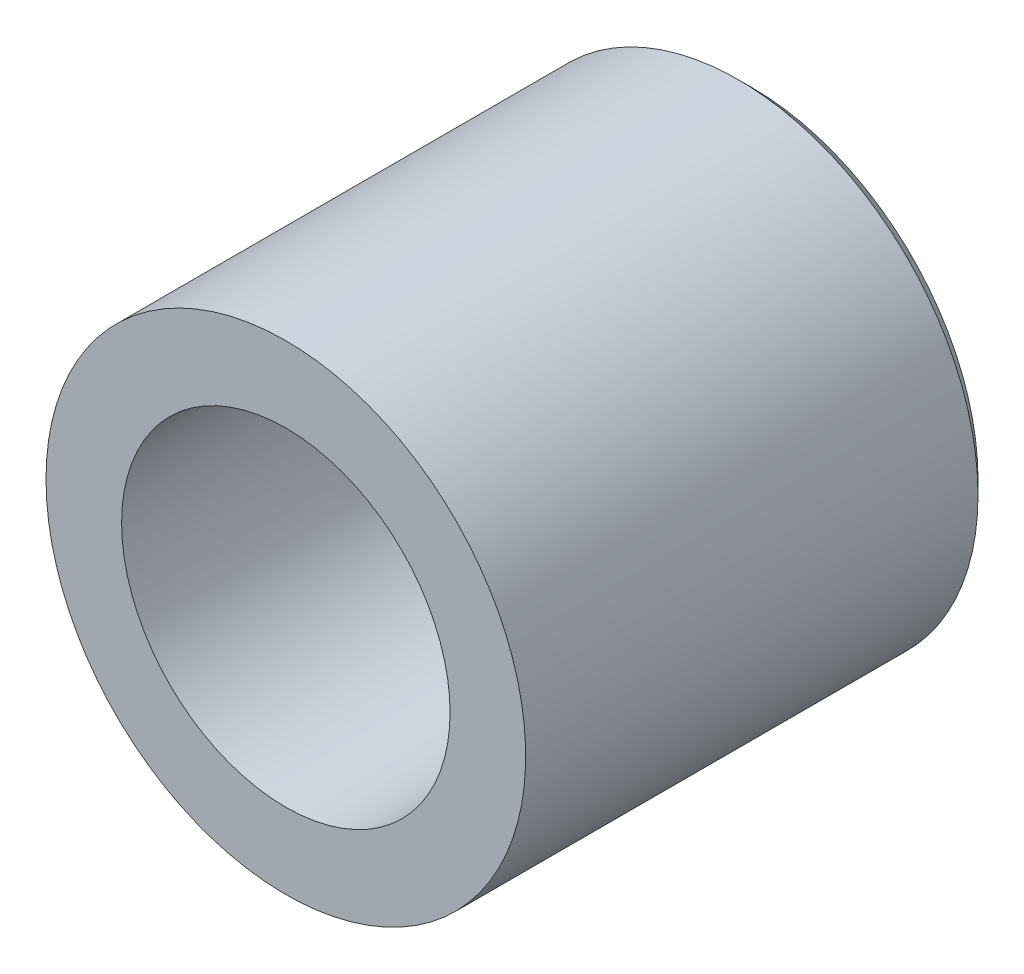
ISO-10303-21;
HEADER;
FILE_DESCRIPTION(('STEP AP214'),'2;1');
FILE_NAME('part.step','',(''),(''),'','','');
FILE_SCHEMA(('AUTOMOTIVE_DESIGN { 1 0 10303 214 1 1 1 1 }'));
ENDSEC;
DATA;
#1=APPLICATION_CONTEXT('core data for automotive mechanical design processes');
#2=APPLICATION_PROTOCOL_DEFINITION('international standard','automotive_design',2000,#1);
#3=PRODUCT_CONTEXT('',#1,'mechanical');
#4=PRODUCT('Part','Part','',(#3));
#5=PRODUCT_RELATED_PRODUCT_CATEGORY('part','',(#4));
#6=PRODUCT_DEFINITION_FORMATION('','',#4);
#7=PRODUCT_DEFINITION_CONTEXT('part definition',#1,'design');
#8=PRODUCT_DEFINITION('design','',#6,#7);
#9=PRODUCT_DEFINITION_SHAPE('','',#8);
#10=(LENGTH_UNIT() NAMED_UNIT(*) SI_UNIT(.MILLI.,.METRE.));
#11=(NAMED_UNIT(*) PLANE_ANGLE_UNIT() SI_UNIT($,.RADIAN.));
#12=(NAMED_UNIT(*) SI_UNIT($,.STERADIAN.) SOLID_ANGLE_UNIT());
#13=UNCERTAINTY_MEASURE_WITH_UNIT(LENGTH_MEASURE(1.E-05),#10,'distance_accuracy_value','');
#14=(GEOMETRIC_REPRESENTATION_CONTEXT(3) GLOBAL_UNCERTAINTY_ASSIGNED_CONTEXT((#13)) GLOBAL_UNIT_ASSIGNED_CONTEXT((#10,
#11,#12)) REPRESENTATION_CONTEXT('',''));
#15=CARTESIAN_POINT('',(0.,0.,0.));
#16=DIRECTION('',(0.,0.,1.));
#17=DIRECTION('',(1.,0.,0.));
#18=AXIS2_PLACEMENT_3D('',#15,#16,#17);
#19=CARTESIAN_POINT('',(-1.05858777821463E-13,0.,-15.1595794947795));
#20=DIRECTION('',(0.,0.,1.));
#21=DIRECTION('',(1.,0.,0.));
#22=AXIS2_PLACEMENT_3D('',#19,#20,#21);
#23=CONICAL_SURFACE('',#22,16.5262293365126,0.785398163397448);
#24=CARTESIAN_POINT('',(-1.46642216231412E-13,0.,-21.));
#25=DIRECTION('',(0.,0.,1.));
#26=DIRECTION('',(-1.,0.,0.));
#27=AXIS2_PLACEMENT_3D('',#24,#25,#26);
#28=CIRCLE('',#27,10.6858088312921);
#29=CARTESIAN_POINT('',(10.6858088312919,0.,-21.));
#30=VERTEX_POINT('',#29);
#31=CARTESIAN_POINT('',(-10.6858088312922,0.,-21.));
#32=VERTEX_POINT('',#31);
#33=EDGE_CURVE('E142',#30,#32,#28,.T.);
#34=ORIENTED_EDGE('',*,*,#33,.F.);
#35=CARTESIAN_POINT('',(10.6858119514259,0.,-20.999996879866));
#36=CARTESIAN_POINT('',(11.6858099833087,0.,-19.9999988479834));
#37=B_SPLINE_CURVE_WITH_KNOTS('',1,(#35,#36),.UNSPECIFIED.,.F.,.F.,(2,2),(0.646597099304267,
0.707106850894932),.UNSPECIFIED.);
#38=CARTESIAN_POINT('',(11.6858088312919,0.,-20.));
#39=VERTEX_POINT('',#38);
#40=EDGE_CURVE('E44',#30,#39,#37,.T.);
#41=ORIENTED_EDGE('',*,*,#40,.T.);
#42=CARTESIAN_POINT('',(-1.39659253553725E-13,0.,-20.));
#43=DIRECTION('',(0.,0.,-1.));
#44=DIRECTION('',(-1.,0.,0.));
#45=AXIS2_PLACEMENT_3D('',#42,#43,#44);
#46=CIRCLE('',#45,11.6858088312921);
#47=CARTESIAN_POINT('',(-11.6858088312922,0.,-20.));
#48=VERTEX_POINT('',#47);
#49=EDGE_CURVE('E11',#48,#39,#46,.T.);
#50=ORIENTED_EDGE('',*,*,#49,.F.);
#51=CARTESIAN_POINT('',(-1.39659253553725E-13,0.,-20.));
#52=DIRECTION('',(0.,0.,-1.));
#53=DIRECTION('',(-1.,0.,0.));
#54=AXIS2_PLACEMENT_3D('',#51,#52,#53);
#55=CIRCLE('',#54,11.6858088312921);
#56=EDGE_CURVE('E51',#39,#48,#55,.T.);
#57=ORIENTED_EDGE('',*,*,#56,.F.);
#58=ORIENTED_EDGE('',*,*,#40,.F.);
#59=CARTESIAN_POINT('',(-1.46642216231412E-13,0.,-21.));
#60=DIRECTION('',(0.,0.,1.));
#61=DIRECTION('',(-1.,0.,0.));
#62=AXIS2_PLACEMENT_3D('',#59,#60,#61);
#63=CIRCLE('',#62,10.6858088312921);
#64=EDGE_CURVE('E59',#32,#30,#63,.T.);
#65=ORIENTED_EDGE('',*,*,#64,.F.);
#66=EDGE_LOOP('',(#34,#41,#50,#57,#58,#65));
#67=FACE_BOUND('',#66,.T.);
#68=ADVANCED_FACE('F36',(#67),#23,.F.);
#69=CARTESIAN_POINT('',(-1.36167772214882E-13,0.,-19.5));
#70=DIRECTION('',(0.,0.,-1.));
#71=DIRECTION('',(-1.,0.,0.));
#72=AXIS2_PLACEMENT_3D('',#69,#70,#71);
#73=CYLINDRICAL_SURFACE('',#72,11.6858088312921);
#74=CARTESIAN_POINT('',(-1.25693328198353E-13,0.,-18.));
#75=DIRECTION('',(0.,0.,-1.));
#76=DIRECTION('',(-1.,0.,0.));
#77=AXIS2_PLACEMENT_3D('',#74,#75,#76);
#78=CIRCLE('',#77,11.6858088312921);
#79=CARTESIAN_POINT('',(-11.6858088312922,0.,-18.));
#80=VERTEX_POINT('',#79);
#81=EDGE_CURVE('E151',#80,#80,#78,.T.);
#82=ORIENTED_EDGE('',*,*,#81,.F.);
#83=CARTESIAN_POINT('',(-11.6858088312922,0.,-17.9999969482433));
#84=CARTESIAN_POINT('',(-11.6858088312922,0.,-20.0000020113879));
#85=B_SPLINE_CURVE_WITH_KNOTS('',1,(#83,#84),.UNSPECIFIED.,.F.,.F.,(2,2),(0.0833320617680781,
0.91666750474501),.UNSPECIFIED.);
#86=EDGE_CURVE('E146',#80,#48,#85,.T.);
#87=ORIENTED_EDGE('',*,*,#86,.T.);
#88=ORIENTED_EDGE('',*,*,#49,.T.);
#89=ORIENTED_EDGE('',*,*,#56,.T.);
#90=ORIENTED_EDGE('',*,*,#86,.F.);
#91=EDGE_LOOP('',(#82,#87,#88,#89,#90));
#92=FACE_BOUND('',#91,.T.);
#93=ADVANCED_FACE('F192',(#92),#73,.F.);
#94=CARTESIAN_POINT('',(24.5773603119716,-22.2100365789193,-21.));
#95=DIRECTION('',(0.,0.,-1.));
#96=DIRECTION('',(-1.,0.,0.));
#97=AXIS2_PLACEMENT_3D('',#94,#95,#96);
#98=PLANE('',#97);
#99=CARTESIAN_POINT('',(-2.44403693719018E-13,0.,-20.9999999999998));
#100=DIRECTION('',(0.,0.,-1.));
#101=DIRECTION('',(-1.,0.,0.));
#102=AXIS2_PLACEMENT_3D('',#99,#100,#101);
#103=CIRCLE('',#102,5.09999999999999);
#104=CARTESIAN_POINT('',(-5.10000000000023,0.,-20.9999999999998));
#105=VERTEX_POINT('',#104);
#106=EDGE_CURVE('E39',#105,#105,#103,.T.);
#107=ORIENTED_EDGE('',*,*,#106,.T.);
#108=EDGE_LOOP('',(#107));
#109=FACE_BOUND('',#108,.T.);
#110=ORIENTED_EDGE('',*,*,#64,.T.);
#111=ORIENTED_EDGE('',*,*,#33,.T.);
#112=EDGE_LOOP('',(#110,#111));
#113=FACE_BOUND('',#112,.T.);
#114=ADVANCED_FACE('F194',(#109,#113),#98,.F.);
#115=CARTESIAN_POINT('',(0.,0.,-1.));
#116=DIRECTION('',(0.,0.,1.));
#117=DIRECTION('',(-1.,0.,0.));
#118=AXIS2_PLACEMENT_3D('',#115,#116,#117);
#119=CONICAL_SURFACE('',#118,11.9825449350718,0.0174532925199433);
#120=ORIENTED_EDGE('',*,*,#81,.T.);
#121=CARTESIAN_POINT('',(-11.6858088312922,0.,-18.));
#122=CARTESIAN_POINT('',(-11.9825449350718,0.,-0.999999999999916));
#123=B_SPLINE_CURVE_WITH_KNOTS('',1,(#121,#122),.UNSPECIFIED.,.F.,.F.,(2,2),(0.,1.),.UNSPECIFIED.);
#124=CARTESIAN_POINT('',(-11.9825449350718,0.,-0.999999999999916));
#125=VERTEX_POINT('',#124);
#126=EDGE_CURVE('E107',#80,#125,#123,.T.);
#127=ORIENTED_EDGE('',*,*,#126,.T.);
#128=CARTESIAN_POINT('',(0.,0.,-1.));
#129=DIRECTION('',(0.,0.,-1.));
#130=DIRECTION('',(1.,0.,0.));
#131=AXIS2_PLACEMENT_3D('',#128,#129,#130);
#132=CIRCLE('',#131,11.9825449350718);
#133=CARTESIAN_POINT('',(11.9825449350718,0.,-1.00000000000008));
#134=VERTEX_POINT('',#133);
#135=EDGE_CURVE('E132',#134,#125,#132,.T.);
#136=ORIENTED_EDGE('',*,*,#135,.F.);
#137=CARTESIAN_POINT('',(0.,0.,-1.));
#138=DIRECTION('',(0.,0.,-1.));
#139=DIRECTION('',(1.,0.,0.));
#140=AXIS2_PLACEMENT_3D('',#137,#138,#139);
#141=CIRCLE('',#140,11.9825449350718);
#142=EDGE_CURVE('E125',#125,#134,#141,.T.);
#143=ORIENTED_EDGE('',*,*,#142,.F.);
#144=ORIENTED_EDGE('',*,*,#126,.F.);
#145=EDGE_LOOP('',(#120,#127,#136,#143,#144));
#146=FACE_BOUND('',#145,.T.);
#147=ADVANCED_FACE('F190',(#146),#119,.F.);
#148=CARTESIAN_POINT('',(-1.86803068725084E-13,0.,-26.7512626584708));
#149=DIRECTION('',(0.,0.,1.));
#150=DIRECTION('',(1.,0.,0.));
#151=AXIS2_PLACEMENT_3D('',#148,#149,#150);
#152=CONICAL_SURFACE('',#151,24.7487373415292,0.785398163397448);
#153=CARTESIAN_POINT('',(-2.4440369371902E-13,0.,-35.));
#154=DIRECTION('',(0.,0.,1.));
#155=DIRECTION('',(-1.,0.,0.));
#156=AXIS2_PLACEMENT_3D('',#153,#154,#155);
#157=CIRCLE('',#156,16.5);
#158=CARTESIAN_POINT('',(-16.5000000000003,0.,-35.));
#159=VERTEX_POINT('',#158);
#160=CARTESIAN_POINT('',(16.4999999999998,0.,-35.));
#161=VERTEX_POINT('',#160);
#162=EDGE_CURVE('E90',#159,#161,#157,.T.);
#163=ORIENTED_EDGE('',*,*,#162,.T.);
#164=CARTESIAN_POINT('',(16.4999992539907,0.,-35.0000007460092));
#165=CARTESIAN_POINT('',(17.4999995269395,0.,-34.0000004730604));
#166=B_SPLINE_CURVE_WITH_KNOTS('',1,(#164,#165),.UNSPECIFIED.,.F.,.F.,(2,2),(0.666700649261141,
0.707106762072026),.UNSPECIFIED.);
#167=CARTESIAN_POINT('',(17.4999999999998,0.,-34.));
#168=VERTEX_POINT('',#167);
#169=EDGE_CURVE('E95',#161,#168,#166,.T.);
#170=ORIENTED_EDGE('',*,*,#169,.T.);
#171=CARTESIAN_POINT('',(-2.37420731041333E-13,0.,-34.));
#172=DIRECTION('',(0.,0.,-1.));
#173=DIRECTION('',(-1.,0.,0.));
#174=AXIS2_PLACEMENT_3D('',#171,#172,#173);
#175=CIRCLE('',#174,17.5);
#176=CARTESIAN_POINT('',(-17.5000000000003,0.,-34.));
#177=VERTEX_POINT('',#176);
#178=EDGE_CURVE('E102',#168,#177,#175,.T.);
#179=ORIENTED_EDGE('',*,*,#178,.T.);
#180=CARTESIAN_POINT('',(-2.37420731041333E-13,0.,-34.));
#181=DIRECTION('',(0.,0.,-1.));
#182=DIRECTION('',(-1.,0.,0.));
#183=AXIS2_PLACEMENT_3D('',#180,#181,#182);
#184=CIRCLE('',#183,17.5);
#185=EDGE_CURVE('E104',#177,#168,#184,.T.);
#186=ORIENTED_EDGE('',*,*,#185,.T.);
#187=ORIENTED_EDGE('',*,*,#169,.F.);
#188=CARTESIAN_POINT('',(-2.4440369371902E-13,0.,-35.));
#189=DIRECTION('',(0.,0.,1.));
#190=DIRECTION('',(-1.,0.,0.));
#191=AXIS2_PLACEMENT_3D('',#188,#189,#190);
#192=CIRCLE('',#191,16.5);
#193=EDGE_CURVE('E97',#161,#159,#192,.T.);
#194=ORIENTED_EDGE('',*,*,#193,.T.);
#195=EDGE_LOOP('',(#163,#170,#179,#186,#187,#194));
#196=FACE_BOUND('',#195,.T.);
#197=ADVANCED_FACE('F92',(#196),#152,.T.);
#198=CARTESIAN_POINT('',(-1.25693328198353E-13,0.,-18.));
#199=DIRECTION('',(0.,0.,-1.));
#200=DIRECTION('',(-1.,0.,0.));
#201=AXIS2_PLACEMENT_3D('',#198,#199,#200);
#202=CYLINDRICAL_SURFACE('',#201,17.5);
#203=CARTESIAN_POINT('',(0.,0.,-1.));
#204=DIRECTION('',(0.,0.,1.));
#205=DIRECTION('',(-1.,0.,0.));
#206=AXIS2_PLACEMENT_3D('',#203,#204,#205);
#207=CIRCLE('',#206,17.5);
#208=CARTESIAN_POINT('',(-17.5,0.,-0.999999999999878));
#209=VERTEX_POINT('',#208);
#210=EDGE_CURVE('E99',#209,#209,#207,.T.);
#211=ORIENTED_EDGE('',*,*,#210,.F.);
#212=CARTESIAN_POINT('',(-17.5,0.,-0.999998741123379));
#213=CARTESIAN_POINT('',(-17.5000000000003,0.,-33.9999995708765));
#214=B_SPLINE_CURVE_WITH_KNOTS('',1,(#212,#213),.UNSPECIFIED.,.F.,.F.,(2,2),(0.0833333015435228,
0.916666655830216),.UNSPECIFIED.);
#215=EDGE_CURVE('E172',#209,#177,#214,.T.);
#216=ORIENTED_EDGE('',*,*,#215,.T.);
#217=ORIENTED_EDGE('',*,*,#178,.F.);
#218=ORIENTED_EDGE('',*,*,#185,.F.);
#219=ORIENTED_EDGE('',*,*,#215,.F.);
#220=EDGE_LOOP('',(#211,#216,#217,#218,#219));
#221=FACE_BOUND('',#220,.T.);
#222=ADVANCED_FACE('F226',(#221),#202,.T.);
#223=CARTESIAN_POINT('',(37.95,-34.2946059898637,-35.));
#224=DIRECTION('',(0.,0.,-1.));
#225=DIRECTION('',(-1.,0.,0.));
#226=AXIS2_PLACEMENT_3D('',#223,#224,#225);
#227=PLANE('',#226);
#228=CARTESIAN_POINT('',(-2.44403693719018E-13,0.,-34.9999999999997));
#229=DIRECTION('',(0.,0.,-1.));
#230=DIRECTION('',(-1.,0.,0.));
#231=AXIS2_PLACEMENT_3D('',#228,#229,#230);
#232=CIRCLE('',#231,5.09999999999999);
#233=CARTESIAN_POINT('',(-5.10000000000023,0.,-34.9999999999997));
#234=VERTEX_POINT('',#233);
#235=EDGE_CURVE('E276',#234,#234,#232,.T.);
#236=ORIENTED_EDGE('',*,*,#235,.F.);
#237=EDGE_LOOP('',(#236));
#238=FACE_BOUND('',#237,.T.);
#239=ORIENTED_EDGE('',*,*,#193,.F.);
#240=ORIENTED_EDGE('',*,*,#162,.F.);
#241=EDGE_LOOP('',(#239,#240));
#242=FACE_BOUND('',#241,.T.);
#243=ADVANCED_FACE('F101',(#238,#242),#227,.T.);
#244=CARTESIAN_POINT('',(-22.75,-36.3730669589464,-0.999999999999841));
#245=DIRECTION('',(0.,0.,1.));
#246=DIRECTION('',(1.,0.,0.));
#247=AXIS2_PLACEMENT_3D('',#244,#245,#246);
#248=PLANE('',#247);
#249=ORIENTED_EDGE('',*,*,#210,.T.);
#250=EDGE_LOOP('',(#249));
#251=FACE_BOUND('',#250,.T.);
#252=ORIENTED_EDGE('',*,*,#135,.T.);
#253=ORIENTED_EDGE('',*,*,#142,.T.);
#254=EDGE_LOOP('',(#252,#253));
#255=FACE_BOUND('',#254,.T.);
#256=ADVANCED_FACE('F241',(#251,#255),#248,.T.);
#257=CARTESIAN_POINT('',(-2.44403693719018E-13,0.,-34.9999999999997));
#258=DIRECTION('',(0.,0.,-1.));
#259=DIRECTION('',(-1.,0.,0.));
#260=AXIS2_PLACEMENT_3D('',#257,#258,#259);
#261=CYLINDRICAL_SURFACE('',#260,5.09999999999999);
#262=ORIENTED_EDGE('',*,*,#235,.T.);
#263=EDGE_LOOP('',(#262));
#264=FACE_BOUND('',#263,.T.);
#265=ORIENTED_EDGE('',*,*,#106,.F.);
#266=EDGE_LOOP('',(#265));
#267=FACE_BOUND('',#266,.T.);
#268=ADVANCED_FACE('F249',(#264,#267),#261,.F.);
#269=CLOSED_SHELL('',(#68,#93,#114,#147,#197,#222,#243,#256,#268));
#270=MANIFOLD_SOLID_BREP('B2',#269);
#271=ADVANCED_BREP_SHAPE_REPRESENTATION('',(#18,#270),#14);
#272=SHAPE_DEFINITION_REPRESENTATION(#9,#271);
ENDSEC;
END-ISO-10303-21;
